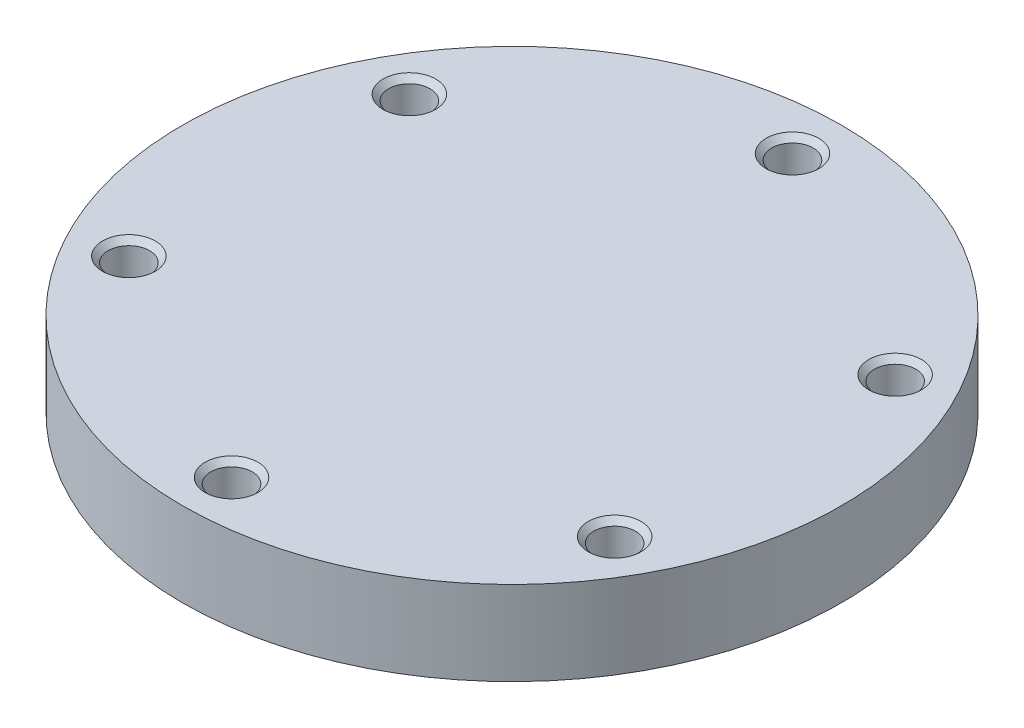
ISO-10303-21;
HEADER;
FILE_DESCRIPTION(('STEP AP214'),'2;1');
FILE_NAME('part.step','',(''),(''),'','','');
FILE_SCHEMA(('AUTOMOTIVE_DESIGN { 1 0 10303 214 1 1 1 1 }'));
ENDSEC;
DATA;
#1=APPLICATION_CONTEXT('core data for automotive mechanical design processes');
#2=APPLICATION_PROTOCOL_DEFINITION('international standard','automotive_design',2000,#1);
#3=PRODUCT_CONTEXT('',#1,'mechanical');
#4=PRODUCT('Part','Part','',(#3));
#5=PRODUCT_RELATED_PRODUCT_CATEGORY('part','',(#4));
#6=PRODUCT_DEFINITION_FORMATION('','',#4);
#7=PRODUCT_DEFINITION_CONTEXT('part definition',#1,'design');
#8=PRODUCT_DEFINITION('design','',#6,#7);
#9=PRODUCT_DEFINITION_SHAPE('','',#8);
#10=(LENGTH_UNIT() NAMED_UNIT(*) SI_UNIT(.MILLI.,.METRE.));
#11=(NAMED_UNIT(*) PLANE_ANGLE_UNIT() SI_UNIT($,.RADIAN.));
#12=(NAMED_UNIT(*) SI_UNIT($,.STERADIAN.) SOLID_ANGLE_UNIT());
#13=UNCERTAINTY_MEASURE_WITH_UNIT(LENGTH_MEASURE(1.E-05),#10,'distance_accuracy_value','');
#14=(GEOMETRIC_REPRESENTATION_CONTEXT(3) GLOBAL_UNCERTAINTY_ASSIGNED_CONTEXT((#13)) GLOBAL_UNIT_ASSIGNED_CONTEXT((#10,
#11,#12)) REPRESENTATION_CONTEXT('',''));
#15=CARTESIAN_POINT('',(0.,0.,0.));
#16=DIRECTION('',(0.,0.,1.));
#17=DIRECTION('',(1.,0.,0.));
#18=AXIS2_PLACEMENT_3D('',#15,#16,#17);
#19=CARTESIAN_POINT('',(0.,9.525,0.));
#20=DIRECTION('',(0.,-1.,0.));
#21=DIRECTION('',(0.,0.,-1.));
#22=AXIS2_PLACEMENT_3D('',#19,#20,#21);
#23=CYLINDRICAL_SURFACE('',#22,37.30625);
#24=CARTESIAN_POINT('',(0.,9.525,0.));
#25=DIRECTION('',(0.,1.,0.));
#26=DIRECTION('',(0.,0.,1.));
#27=AXIS2_PLACEMENT_3D('',#24,#25,#26);
#28=CIRCLE('',#27,37.30625);
#29=CARTESIAN_POINT('',(0.,9.525,-37.30625));
#30=VERTEX_POINT('',#29);
#31=EDGE_CURVE('E10',#30,#30,#28,.T.);
#32=CARTESIAN_POINT('',(0.,0.,0.));
#33=DIRECTION('',(0.,1.,0.));
#34=DIRECTION('',(0.,0.,1.));
#35=AXIS2_PLACEMENT_3D('',#32,#33,#34);
#36=CIRCLE('',#35,37.30625);
#37=CARTESIAN_POINT('',(0.,0.,-37.30625));
#38=VERTEX_POINT('',#37);
#39=EDGE_CURVE('E37',#38,#38,#36,.T.);
#40=CARTESIAN_POINT('',(0.,9.525,-37.30625));
#41=CARTESIAN_POINT('',(0.,9.42578125,-37.30625));
#42=CARTESIAN_POINT('',(0.,9.3265625,-37.30625));
#43=CARTESIAN_POINT('',(0.,9.128125,-37.30625));
#44=CARTESIAN_POINT('',(0.,9.02890625,-37.30625));
#45=CARTESIAN_POINT('',(0.,8.83046875,-37.30625));
#46=CARTESIAN_POINT('',(0.,8.73125,-37.30625));
#47=CARTESIAN_POINT('',(0.,8.5328125,-37.30625));
#48=CARTESIAN_POINT('',(0.,8.43359375,-37.30625));
#49=CARTESIAN_POINT('',(0.,8.23515625,-37.30625));
#50=CARTESIAN_POINT('',(0.,8.1359375,-37.30625));
#51=CARTESIAN_POINT('',(0.,7.9375,-37.30625));
#52=CARTESIAN_POINT('',(0.,7.83828125,-37.30625));
#53=CARTESIAN_POINT('',(0.,7.63984375,-37.30625));
#54=CARTESIAN_POINT('',(0.,7.540625,-37.30625));
#55=CARTESIAN_POINT('',(0.,7.3421875,-37.30625));
#56=CARTESIAN_POINT('',(0.,7.24296875,-37.30625));
#57=CARTESIAN_POINT('',(0.,7.04453125,-37.30625));
#58=CARTESIAN_POINT('',(0.,6.9453125,-37.30625));
#59=CARTESIAN_POINT('',(0.,6.746875,-37.30625));
#60=CARTESIAN_POINT('',(0.,6.64765625,-37.30625));
#61=CARTESIAN_POINT('',(0.,6.44921875,-37.30625));
#62=CARTESIAN_POINT('',(0.,6.35,-37.30625));
#63=CARTESIAN_POINT('',(0.,6.1515625,-37.30625));
#64=CARTESIAN_POINT('',(0.,6.05234375,-37.30625));
#65=CARTESIAN_POINT('',(0.,5.85390625,-37.30625));
#66=CARTESIAN_POINT('',(0.,5.7546875,-37.30625));
#67=CARTESIAN_POINT('',(0.,5.55625,-37.30625));
#68=CARTESIAN_POINT('',(0.,5.45703125,-37.30625));
#69=CARTESIAN_POINT('',(0.,5.25859375,-37.30625));
#70=CARTESIAN_POINT('',(0.,5.159375,-37.30625));
#71=CARTESIAN_POINT('',(0.,4.9609375,-37.30625));
#72=CARTESIAN_POINT('',(0.,4.86171875,-37.30625));
#73=CARTESIAN_POINT('',(0.,4.66328125,-37.30625));
#74=CARTESIAN_POINT('',(0.,4.5640625,-37.30625));
#75=CARTESIAN_POINT('',(0.,4.365625,-37.30625));
#76=CARTESIAN_POINT('',(0.,4.26640625,-37.30625));
#77=CARTESIAN_POINT('',(0.,4.06796875,-37.30625));
#78=CARTESIAN_POINT('',(0.,3.96875,-37.30625));
#79=CARTESIAN_POINT('',(0.,3.7703125,-37.30625));
#80=CARTESIAN_POINT('',(0.,3.67109375,-37.30625));
#81=CARTESIAN_POINT('',(0.,3.47265625,-37.30625));
#82=CARTESIAN_POINT('',(0.,3.3734375,-37.30625));
#83=CARTESIAN_POINT('',(0.,3.175,-37.30625));
#84=CARTESIAN_POINT('',(0.,3.07578125,-37.30625));
#85=CARTESIAN_POINT('',(0.,2.87734375,-37.30625));
#86=CARTESIAN_POINT('',(0.,2.778125,-37.30625));
#87=CARTESIAN_POINT('',(0.,2.5796875,-37.30625));
#88=CARTESIAN_POINT('',(0.,2.48046875,-37.30625));
#89=CARTESIAN_POINT('',(0.,2.28203125,-37.30625));
#90=CARTESIAN_POINT('',(0.,2.1828125,-37.30625));
#91=CARTESIAN_POINT('',(0.,1.984375,-37.30625));
#92=CARTESIAN_POINT('',(0.,1.88515625,-37.30625));
#93=CARTESIAN_POINT('',(0.,1.68671875,-37.30625));
#94=CARTESIAN_POINT('',(0.,1.5875,-37.30625));
#95=CARTESIAN_POINT('',(0.,1.3890625,-37.30625));
#96=CARTESIAN_POINT('',(0.,1.28984375,-37.30625));
#97=CARTESIAN_POINT('',(0.,1.09140625,-37.30625));
#98=CARTESIAN_POINT('',(0.,0.992187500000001,-37.30625));
#99=CARTESIAN_POINT('',(0.,0.793750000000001,-37.30625));
#100=CARTESIAN_POINT('',(0.,0.69453125,-37.30625));
#101=CARTESIAN_POINT('',(0.,0.49609375,-37.30625));
#102=CARTESIAN_POINT('',(0.,0.396875,-37.30625));
#103=CARTESIAN_POINT('',(0.,0.1984375,-37.30625));
#104=CARTESIAN_POINT('',(0.,0.0992187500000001,-37.30625));
#105=CARTESIAN_POINT('',(0.,0.,-37.30625));
#106=B_SPLINE_CURVE_WITH_KNOTS('',3,(#40,#41,#42,#43,#44,#45,#46,#47,#48,#49,#50,#51,#52,#53,
#54,#55,#56,#57,#58,#59,#60,#61,#62,#63,#64,#65,#66,#67,#68,#69,#70,#71,#72,#73,#74,#75,#76,#77,
#78,#79,#80,#81,#82,#83,#84,#85,#86,#87,#88,#89,#90,#91,#92,#93,#94,#95,#96,#97,#98,#99,#100,
#101,#102,#103,#104,#105),.UNSPECIFIED.,.F.,.F.,(4,2,2,2,2,2,2,2,2,2,2,2,2,2,2,2,2,2,2,2,2,2,2,
2,2,2,2,2,2,2,2,2,4),(0.,0.297656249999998,0.595312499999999,0.892968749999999,1.190625,
1.48828125,1.7859375,2.08359375,2.38125,2.67890625,2.9765625,3.27421875,3.571875,3.86953125,
4.1671875,4.46484375,4.7625,5.06015625,5.3578125,5.65546875,5.953125,6.25078125,6.5484375,
6.84609375,7.14375,7.44140625,7.7390625,8.03671875,8.334375,8.63203125,8.9296875,9.22734375,
9.525),.UNSPECIFIED.);
#107=EDGE_CURVE('BSEAM34',#30,#38,#106,.T.);
#108=ORIENTED_EDGE('',*,*,#31,.F.);
#109=ORIENTED_EDGE('',*,*,#39,.T.);
#110=ORIENTED_EDGE('',*,*,#107,.T.);
#111=ORIENTED_EDGE('',*,*,#107,.F.);
#112=EDGE_LOOP('',(#108,#110,#109,#111));
#113=FACE_BOUND('',#112,.T.);
#114=ADVANCED_FACE('F34',(#113),#23,.T.);
#115=CARTESIAN_POINT('',(0.,9.525,0.));
#116=DIRECTION('',(0.,1.,0.));
#117=DIRECTION('',(0.,0.,1.));
#118=AXIS2_PLACEMENT_3D('',#115,#116,#117);
#119=PLANE('',#118);
#120=CARTESIAN_POINT('',(0.,9.525,-31.75));
#121=DIRECTION('',(0.,1.,0.));
#122=DIRECTION('',(0.,0.,1.));
#123=AXIS2_PLACEMENT_3D('',#120,#121,#122);
#124=CIRCLE('',#123,2.9845);
#125=CARTESIAN_POINT('',(0.,9.525,-28.7655));
#126=VERTEX_POINT('',#125);
#127=EDGE_CURVE('E111',#126,#126,#124,.T.);
#128=ORIENTED_EDGE('',*,*,#127,.F.);
#129=EDGE_LOOP('',(#128));
#130=FACE_BOUND('',#129,.T.);
#131=CARTESIAN_POINT('',(27.4963065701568,9.525,-15.8750000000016));
#132=DIRECTION('',(0.,1.,0.));
#133=DIRECTION('',(0.,0.,1.));
#134=AXIS2_PLACEMENT_3D('',#131,#132,#133);
#135=CIRCLE('',#134,2.9845);
#136=CARTESIAN_POINT('',(27.4963065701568,9.525,-12.8905000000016));
#137=VERTEX_POINT('',#136);
#138=EDGE_CURVE('E99',#137,#137,#135,.T.);
#139=ORIENTED_EDGE('',*,*,#138,.F.);
#140=EDGE_LOOP('',(#139));
#141=FACE_BOUND('',#140,.T.);
#142=CARTESIAN_POINT('',(27.4963065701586,9.525,15.8749999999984));
#143=DIRECTION('',(0.,1.,0.));
#144=DIRECTION('',(0.,0.,1.));
#145=AXIS2_PLACEMENT_3D('',#142,#143,#144);
#146=CIRCLE('',#145,2.9845);
#147=CARTESIAN_POINT('',(27.4963065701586,9.525,18.8594999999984));
#148=VERTEX_POINT('',#147);
#149=EDGE_CURVE('E87',#148,#148,#146,.T.);
#150=ORIENTED_EDGE('',*,*,#149,.F.);
#151=EDGE_LOOP('',(#150));
#152=FACE_BOUND('',#151,.T.);
#153=CARTESIAN_POINT('',(3.59789233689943E-12,9.525,31.75));
#154=DIRECTION('',(0.,1.,0.));
#155=DIRECTION('',(0.,0.,1.));
#156=AXIS2_PLACEMENT_3D('',#153,#154,#155);
#157=CIRCLE('',#156,2.9845);
#158=CARTESIAN_POINT('',(3.59789233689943E-12,9.525,34.7345));
#159=VERTEX_POINT('',#158);
#160=EDGE_CURVE('E75',#159,#159,#157,.T.);
#161=ORIENTED_EDGE('',*,*,#160,.F.);
#162=EDGE_LOOP('',(#161));
#163=FACE_BOUND('',#162,.T.);
#164=CARTESIAN_POINT('',(-27.4963065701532,9.525,15.8750000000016));
#165=DIRECTION('',(0.,1.,0.));
#166=DIRECTION('',(0.,0.,1.));
#167=AXIS2_PLACEMENT_3D('',#164,#165,#166);
#168=CIRCLE('',#167,2.9845);
#169=CARTESIAN_POINT('',(-27.4963065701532,9.525,18.8595000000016));
#170=VERTEX_POINT('',#169);
#171=EDGE_CURVE('E63',#170,#170,#168,.T.);
#172=ORIENTED_EDGE('',*,*,#171,.F.);
#173=EDGE_LOOP('',(#172));
#174=FACE_BOUND('',#173,.T.);
#175=CARTESIAN_POINT('',(-27.496306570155,9.525,-15.8749999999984));
#176=DIRECTION('',(0.,1.,0.));
#177=DIRECTION('',(0.,0.,1.));
#178=AXIS2_PLACEMENT_3D('',#175,#176,#177);
#179=CIRCLE('',#178,2.9845);
#180=CARTESIAN_POINT('',(-27.496306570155,9.525,-12.8904999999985));
#181=VERTEX_POINT('',#180);
#182=EDGE_CURVE('E51',#181,#181,#179,.T.);
#183=ORIENTED_EDGE('',*,*,#182,.F.);
#184=EDGE_LOOP('',(#183));
#185=FACE_BOUND('',#184,.T.);
#186=ORIENTED_EDGE('',*,*,#31,.T.);
#187=EDGE_LOOP('',(#186));
#188=FACE_BOUND('',#187,.T.);
#189=ADVANCED_FACE('F150',(#130,#141,#152,#163,#174,#185,#188),#119,.T.);
#190=CARTESIAN_POINT('',(0.,0.,0.));
#191=DIRECTION('',(0.,1.,0.));
#192=DIRECTION('',(0.,0.,1.));
#193=AXIS2_PLACEMENT_3D('',#190,#191,#192);
#194=PLANE('',#193);
#195=CARTESIAN_POINT('',(0.,0.,0.));
#196=DIRECTION('',(0.,-1.,0.));
#197=DIRECTION('',(0.,0.,-1.));
#198=AXIS2_PLACEMENT_3D('',#195,#196,#197);
#199=CIRCLE('',#198,27.6987);
#200=CARTESIAN_POINT('',(0.,0.,-27.6987));
#201=VERTEX_POINT('',#200);
#202=EDGE_CURVE('E118',#201,#201,#199,.T.);
#203=ORIENTED_EDGE('',*,*,#202,.F.);
#204=EDGE_LOOP('',(#203));
#205=FACE_BOUND('',#204,.T.);
#206=CARTESIAN_POINT('',(0.,0.,-31.75));
#207=DIRECTION('',(0.,1.,0.));
#208=DIRECTION('',(0.,0.,1.));
#209=AXIS2_PLACEMENT_3D('',#206,#207,#208);
#210=CIRCLE('',#209,2.9845);
#211=CARTESIAN_POINT('',(0.,0.,-28.7655));
#212=VERTEX_POINT('',#211);
#213=EDGE_CURVE('E114',#212,#212,#210,.T.);
#214=ORIENTED_EDGE('',*,*,#213,.T.);
#215=EDGE_LOOP('',(#214));
#216=FACE_BOUND('',#215,.T.);
#217=CARTESIAN_POINT('',(27.4963065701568,0.,-15.8750000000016));
#218=DIRECTION('',(0.,1.,0.));
#219=DIRECTION('',(0.,0.,1.));
#220=AXIS2_PLACEMENT_3D('',#217,#218,#219);
#221=CIRCLE('',#220,2.9845);
#222=CARTESIAN_POINT('',(27.4963065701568,0.,-12.8905000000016));
#223=VERTEX_POINT('',#222);
#224=EDGE_CURVE('E102',#223,#223,#221,.T.);
#225=ORIENTED_EDGE('',*,*,#224,.T.);
#226=EDGE_LOOP('',(#225));
#227=FACE_BOUND('',#226,.T.);
#228=CARTESIAN_POINT('',(27.4963065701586,0.,15.8749999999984));
#229=DIRECTION('',(0.,1.,0.));
#230=DIRECTION('',(0.,0.,1.));
#231=AXIS2_PLACEMENT_3D('',#228,#229,#230);
#232=CIRCLE('',#231,2.9845);
#233=CARTESIAN_POINT('',(27.4963065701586,0.,18.8594999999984));
#234=VERTEX_POINT('',#233);
#235=EDGE_CURVE('E90',#234,#234,#232,.T.);
#236=ORIENTED_EDGE('',*,*,#235,.T.);
#237=EDGE_LOOP('',(#236));
#238=FACE_BOUND('',#237,.T.);
#239=CARTESIAN_POINT('',(3.59789233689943E-12,0.,31.75));
#240=DIRECTION('',(0.,1.,0.));
#241=DIRECTION('',(0.,0.,1.));
#242=AXIS2_PLACEMENT_3D('',#239,#240,#241);
#243=CIRCLE('',#242,2.9845);
#244=CARTESIAN_POINT('',(3.59789233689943E-12,0.,34.7345));
#245=VERTEX_POINT('',#244);
#246=EDGE_CURVE('E78',#245,#245,#243,.T.);
#247=ORIENTED_EDGE('',*,*,#246,.T.);
#248=EDGE_LOOP('',(#247));
#249=FACE_BOUND('',#248,.T.);
#250=CARTESIAN_POINT('',(-27.4963065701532,0.,15.8750000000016));
#251=DIRECTION('',(0.,1.,0.));
#252=DIRECTION('',(0.,0.,1.));
#253=AXIS2_PLACEMENT_3D('',#250,#251,#252);
#254=CIRCLE('',#253,2.9845);
#255=CARTESIAN_POINT('',(-27.4963065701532,0.,18.8595000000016));
#256=VERTEX_POINT('',#255);
#257=EDGE_CURVE('E66',#256,#256,#254,.T.);
#258=ORIENTED_EDGE('',*,*,#257,.T.);
#259=EDGE_LOOP('',(#258));
#260=FACE_BOUND('',#259,.T.);
#261=CARTESIAN_POINT('',(-27.496306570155,0.,-15.8749999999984));
#262=DIRECTION('',(0.,1.,0.));
#263=DIRECTION('',(0.,0.,1.));
#264=AXIS2_PLACEMENT_3D('',#261,#262,#263);
#265=CIRCLE('',#264,2.9845);
#266=CARTESIAN_POINT('',(-27.496306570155,0.,-12.8904999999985));
#267=VERTEX_POINT('',#266);
#268=EDGE_CURVE('E54',#267,#267,#265,.T.);
#269=ORIENTED_EDGE('',*,*,#268,.T.);
#270=EDGE_LOOP('',(#269));
#271=FACE_BOUND('',#270,.T.);
#272=ORIENTED_EDGE('',*,*,#39,.F.);
#273=EDGE_LOOP('',(#272));
#274=FACE_BOUND('',#273,.T.);
#275=ADVANCED_FACE('F146',(#205,#216,#227,#238,#249,#260,#271,#274),#194,.F.);
#276=CARTESIAN_POINT('',(-27.496306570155,0.635000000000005,-15.8749999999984));
#277=DIRECTION('',(0.,-1.,0.));
#278=DIRECTION('',(0.,0.,-1.));
#279=AXIS2_PLACEMENT_3D('',#276,#277,#278);
#280=CONICAL_SURFACE('',#279,2.3495,0.785398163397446);
#281=ORIENTED_EDGE('',*,*,#268,.F.);
#282=EDGE_LOOP('',(#281));
#283=FACE_BOUND('',#282,.T.);
#284=CARTESIAN_POINT('',(-27.496306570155,0.635000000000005,-15.8749999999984));
#285=DIRECTION('',(0.,1.,0.));
#286=DIRECTION('',(0.,0.,1.));
#287=AXIS2_PLACEMENT_3D('',#284,#285,#286);
#288=CIRCLE('',#287,2.3495);
#289=CARTESIAN_POINT('',(-27.496306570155,0.635000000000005,-13.5254999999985));
#290=VERTEX_POINT('',#289);
#291=EDGE_CURVE('E44',#290,#290,#288,.T.);
#292=ORIENTED_EDGE('',*,*,#291,.T.);
#293=EDGE_LOOP('',(#292));
#294=FACE_BOUND('',#293,.T.);
#295=ADVANCED_FACE('F149',(#283,#294),#280,.F.);
#296=CARTESIAN_POINT('',(-27.496306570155,9.525,-15.8749999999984));
#297=DIRECTION('',(0.,1.,0.));
#298=DIRECTION('',(0.,0.,1.));
#299=AXIS2_PLACEMENT_3D('',#296,#297,#298);
#300=CYLINDRICAL_SURFACE('',#299,2.3495);
#301=ORIENTED_EDGE('',*,*,#291,.F.);
#302=EDGE_LOOP('',(#301));
#303=FACE_BOUND('',#302,.T.);
#304=CARTESIAN_POINT('',(-27.496306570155,8.89,-15.8749999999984));
#305=DIRECTION('',(0.,1.,0.));
#306=DIRECTION('',(0.,0.,1.));
#307=AXIS2_PLACEMENT_3D('',#304,#305,#306);
#308=CIRCLE('',#307,2.3495);
#309=CARTESIAN_POINT('',(-27.496306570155,8.89,-13.5254999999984));
#310=VERTEX_POINT('',#309);
#311=EDGE_CURVE('E48',#310,#310,#308,.T.);
#312=ORIENTED_EDGE('',*,*,#311,.T.);
#313=EDGE_LOOP('',(#312));
#314=FACE_BOUND('',#313,.T.);
#315=ADVANCED_FACE('F180',(#303,#314),#300,.F.);
#316=CARTESIAN_POINT('',(-27.496306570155,9.525,-15.8749999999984));
#317=DIRECTION('',(0.,1.,0.));
#318=DIRECTION('',(0.,0.,1.));
#319=AXIS2_PLACEMENT_3D('',#316,#317,#318);
#320=CONICAL_SURFACE('',#319,2.9845,0.785398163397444);
#321=ORIENTED_EDGE('',*,*,#311,.F.);
#322=EDGE_LOOP('',(#321));
#323=FACE_BOUND('',#322,.T.);
#324=ORIENTED_EDGE('',*,*,#182,.T.);
#325=EDGE_LOOP('',(#324));
#326=FACE_BOUND('',#325,.T.);
#327=ADVANCED_FACE('F184',(#323,#326),#320,.F.);
#328=CARTESIAN_POINT('',(-27.4963065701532,0.635000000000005,15.8750000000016));
#329=DIRECTION('',(0.,-1.,0.));
#330=DIRECTION('',(0.,0.,-1.));
#331=AXIS2_PLACEMENT_3D('',#328,#329,#330);
#332=CONICAL_SURFACE('',#331,2.3495,0.785398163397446);
#333=ORIENTED_EDGE('',*,*,#257,.F.);
#334=EDGE_LOOP('',(#333));
#335=FACE_BOUND('',#334,.T.);
#336=CARTESIAN_POINT('',(-27.4963065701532,0.635000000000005,15.8750000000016));
#337=DIRECTION('',(0.,1.,0.));
#338=DIRECTION('',(0.,0.,1.));
#339=AXIS2_PLACEMENT_3D('',#336,#337,#338);
#340=CIRCLE('',#339,2.3495);
#341=CARTESIAN_POINT('',(-27.4963065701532,0.635000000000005,18.2245000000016));
#342=VERTEX_POINT('',#341);
#343=EDGE_CURVE('E57',#342,#342,#340,.T.);
#344=ORIENTED_EDGE('',*,*,#343,.T.);
#345=EDGE_LOOP('',(#344));
#346=FACE_BOUND('',#345,.T.);
#347=ADVANCED_FACE('F188',(#335,#346),#332,.F.);
#348=CARTESIAN_POINT('',(-27.4963065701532,9.525,15.8750000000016));
#349=DIRECTION('',(0.,1.,0.));
#350=DIRECTION('',(0.,0.,1.));
#351=AXIS2_PLACEMENT_3D('',#348,#349,#350);
#352=CYLINDRICAL_SURFACE('',#351,2.3495);
#353=ORIENTED_EDGE('',*,*,#343,.F.);
#354=EDGE_LOOP('',(#353));
#355=FACE_BOUND('',#354,.T.);
#356=CARTESIAN_POINT('',(-27.4963065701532,8.89,15.8750000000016));
#357=DIRECTION('',(0.,1.,0.));
#358=DIRECTION('',(0.,0.,1.));
#359=AXIS2_PLACEMENT_3D('',#356,#357,#358);
#360=CIRCLE('',#359,2.3495);
#361=CARTESIAN_POINT('',(-27.4963065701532,8.89,18.2245000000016));
#362=VERTEX_POINT('',#361);
#363=EDGE_CURVE('E60',#362,#362,#360,.T.);
#364=ORIENTED_EDGE('',*,*,#363,.T.);
#365=EDGE_LOOP('',(#364));
#366=FACE_BOUND('',#365,.T.);
#367=ADVANCED_FACE('F192',(#355,#366),#352,.F.);
#368=CARTESIAN_POINT('',(-27.4963065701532,9.525,15.8750000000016));
#369=DIRECTION('',(0.,1.,0.));
#370=DIRECTION('',(0.,0.,1.));
#371=AXIS2_PLACEMENT_3D('',#368,#369,#370);
#372=CONICAL_SURFACE('',#371,2.9845,0.785398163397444);
#373=ORIENTED_EDGE('',*,*,#363,.F.);
#374=EDGE_LOOP('',(#373));
#375=FACE_BOUND('',#374,.T.);
#376=ORIENTED_EDGE('',*,*,#171,.T.);
#377=EDGE_LOOP('',(#376));
#378=FACE_BOUND('',#377,.T.);
#379=ADVANCED_FACE('F196',(#375,#378),#372,.F.);
#380=CARTESIAN_POINT('',(3.59789233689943E-12,0.635000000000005,31.75));
#381=DIRECTION('',(0.,-1.,0.));
#382=DIRECTION('',(0.,0.,-1.));
#383=AXIS2_PLACEMENT_3D('',#380,#381,#382);
#384=CONICAL_SURFACE('',#383,2.3495,0.785398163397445);
#385=ORIENTED_EDGE('',*,*,#246,.F.);
#386=EDGE_LOOP('',(#385));
#387=FACE_BOUND('',#386,.T.);
#388=CARTESIAN_POINT('',(3.59789233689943E-12,0.635000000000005,31.75));
#389=DIRECTION('',(0.,1.,0.));
#390=DIRECTION('',(0.,0.,1.));
#391=AXIS2_PLACEMENT_3D('',#388,#389,#390);
#392=CIRCLE('',#391,2.3495);
#393=CARTESIAN_POINT('',(3.59789233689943E-12,0.635000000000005,34.0995));
#394=VERTEX_POINT('',#393);
#395=EDGE_CURVE('E69',#394,#394,#392,.T.);
#396=ORIENTED_EDGE('',*,*,#395,.T.);
#397=EDGE_LOOP('',(#396));
#398=FACE_BOUND('',#397,.T.);
#399=ADVANCED_FACE('F200',(#387,#398),#384,.F.);
#400=CARTESIAN_POINT('',(3.59789233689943E-12,9.525,31.75));
#401=DIRECTION('',(0.,1.,0.));
#402=DIRECTION('',(0.,0.,1.));
#403=AXIS2_PLACEMENT_3D('',#400,#401,#402);
#404=CYLINDRICAL_SURFACE('',#403,2.3495);
#405=ORIENTED_EDGE('',*,*,#395,.F.);
#406=EDGE_LOOP('',(#405));
#407=FACE_BOUND('',#406,.T.);
#408=CARTESIAN_POINT('',(3.59789233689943E-12,8.89,31.75));
#409=DIRECTION('',(0.,1.,0.));
#410=DIRECTION('',(0.,0.,1.));
#411=AXIS2_PLACEMENT_3D('',#408,#409,#410);
#412=CIRCLE('',#411,2.3495);
#413=CARTESIAN_POINT('',(3.59789233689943E-12,8.89,34.0995));
#414=VERTEX_POINT('',#413);
#415=EDGE_CURVE('E72',#414,#414,#412,.T.);
#416=ORIENTED_EDGE('',*,*,#415,.T.);
#417=EDGE_LOOP('',(#416));
#418=FACE_BOUND('',#417,.T.);
#419=ADVANCED_FACE('F204',(#407,#418),#404,.F.);
#420=CARTESIAN_POINT('',(3.59789233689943E-12,9.525,31.75));
#421=DIRECTION('',(0.,1.,0.));
#422=DIRECTION('',(0.,0.,1.));
#423=AXIS2_PLACEMENT_3D('',#420,#421,#422);
#424=CONICAL_SURFACE('',#423,2.9845,0.785398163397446);
#425=ORIENTED_EDGE('',*,*,#415,.F.);
#426=EDGE_LOOP('',(#425));
#427=FACE_BOUND('',#426,.T.);
#428=ORIENTED_EDGE('',*,*,#160,.T.);
#429=EDGE_LOOP('',(#428));
#430=FACE_BOUND('',#429,.T.);
#431=ADVANCED_FACE('F208',(#427,#430),#424,.F.);
#432=CARTESIAN_POINT('',(27.4963065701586,0.635000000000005,15.8749999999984));
#433=DIRECTION('',(0.,-1.,0.));
#434=DIRECTION('',(0.,0.,-1.));
#435=AXIS2_PLACEMENT_3D('',#432,#433,#434);
#436=CONICAL_SURFACE('',#435,2.3495,0.785398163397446);
#437=ORIENTED_EDGE('',*,*,#235,.F.);
#438=EDGE_LOOP('',(#437));
#439=FACE_BOUND('',#438,.T.);
#440=CARTESIAN_POINT('',(27.4963065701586,0.635000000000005,15.8749999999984));
#441=DIRECTION('',(0.,1.,0.));
#442=DIRECTION('',(0.,0.,1.));
#443=AXIS2_PLACEMENT_3D('',#440,#441,#442);
#444=CIRCLE('',#443,2.3495);
#445=CARTESIAN_POINT('',(27.4963065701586,0.635000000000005,18.2244999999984));
#446=VERTEX_POINT('',#445);
#447=EDGE_CURVE('E81',#446,#446,#444,.T.);
#448=ORIENTED_EDGE('',*,*,#447,.T.);
#449=EDGE_LOOP('',(#448));
#450=FACE_BOUND('',#449,.T.);
#451=ADVANCED_FACE('F212',(#439,#450),#436,.F.);
#452=CARTESIAN_POINT('',(27.4963065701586,9.525,15.8749999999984));
#453=DIRECTION('',(0.,1.,0.));
#454=DIRECTION('',(0.,0.,1.));
#455=AXIS2_PLACEMENT_3D('',#452,#453,#454);
#456=CYLINDRICAL_SURFACE('',#455,2.3495);
#457=ORIENTED_EDGE('',*,*,#447,.F.);
#458=EDGE_LOOP('',(#457));
#459=FACE_BOUND('',#458,.T.);
#460=CARTESIAN_POINT('',(27.4963065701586,8.89,15.8749999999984));
#461=DIRECTION('',(0.,1.,0.));
#462=DIRECTION('',(0.,0.,1.));
#463=AXIS2_PLACEMENT_3D('',#460,#461,#462);
#464=CIRCLE('',#463,2.3495);
#465=CARTESIAN_POINT('',(27.4963065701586,8.89,18.2244999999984));
#466=VERTEX_POINT('',#465);
#467=EDGE_CURVE('E84',#466,#466,#464,.T.);
#468=ORIENTED_EDGE('',*,*,#467,.T.);
#469=EDGE_LOOP('',(#468));
#470=FACE_BOUND('',#469,.T.);
#471=ADVANCED_FACE('F216',(#459,#470),#456,.F.);
#472=CARTESIAN_POINT('',(27.4963065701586,9.525,15.8749999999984));
#473=DIRECTION('',(0.,1.,0.));
#474=DIRECTION('',(0.,0.,1.));
#475=AXIS2_PLACEMENT_3D('',#472,#473,#474);
#476=CONICAL_SURFACE('',#475,2.9845,0.785398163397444);
#477=ORIENTED_EDGE('',*,*,#467,.F.);
#478=EDGE_LOOP('',(#477));
#479=FACE_BOUND('',#478,.T.);
#480=ORIENTED_EDGE('',*,*,#149,.T.);
#481=EDGE_LOOP('',(#480));
#482=FACE_BOUND('',#481,.T.);
#483=ADVANCED_FACE('F220',(#479,#482),#476,.F.);
#484=CARTESIAN_POINT('',(27.4963065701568,0.635000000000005,-15.8750000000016));
#485=DIRECTION('',(0.,-1.,0.));
#486=DIRECTION('',(0.,0.,-1.));
#487=AXIS2_PLACEMENT_3D('',#484,#485,#486);
#488=CONICAL_SURFACE('',#487,2.3495,0.785398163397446);
#489=ORIENTED_EDGE('',*,*,#224,.F.);
#490=EDGE_LOOP('',(#489));
#491=FACE_BOUND('',#490,.T.);
#492=CARTESIAN_POINT('',(27.4963065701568,0.635000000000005,-15.8750000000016));
#493=DIRECTION('',(0.,1.,0.));
#494=DIRECTION('',(0.,0.,1.));
#495=AXIS2_PLACEMENT_3D('',#492,#493,#494);
#496=CIRCLE('',#495,2.3495);
#497=CARTESIAN_POINT('',(27.4963065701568,0.635000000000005,-13.5255000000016));
#498=VERTEX_POINT('',#497);
#499=EDGE_CURVE('E93',#498,#498,#496,.T.);
#500=ORIENTED_EDGE('',*,*,#499,.T.);
#501=EDGE_LOOP('',(#500));
#502=FACE_BOUND('',#501,.T.);
#503=ADVANCED_FACE('F224',(#491,#502),#488,.F.);
#504=CARTESIAN_POINT('',(27.4963065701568,9.525,-15.8750000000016));
#505=DIRECTION('',(0.,1.,0.));
#506=DIRECTION('',(0.,0.,1.));
#507=AXIS2_PLACEMENT_3D('',#504,#505,#506);
#508=CYLINDRICAL_SURFACE('',#507,2.3495);
#509=ORIENTED_EDGE('',*,*,#499,.F.);
#510=EDGE_LOOP('',(#509));
#511=FACE_BOUND('',#510,.T.);
#512=CARTESIAN_POINT('',(27.4963065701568,8.89,-15.8750000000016));
#513=DIRECTION('',(0.,1.,0.));
#514=DIRECTION('',(0.,0.,1.));
#515=AXIS2_PLACEMENT_3D('',#512,#513,#514);
#516=CIRCLE('',#515,2.3495);
#517=CARTESIAN_POINT('',(27.4963065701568,8.89,-13.5255000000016));
#518=VERTEX_POINT('',#517);
#519=EDGE_CURVE('E96',#518,#518,#516,.T.);
#520=ORIENTED_EDGE('',*,*,#519,.T.);
#521=EDGE_LOOP('',(#520));
#522=FACE_BOUND('',#521,.T.);
#523=ADVANCED_FACE('F228',(#511,#522),#508,.F.);
#524=CARTESIAN_POINT('',(27.4963065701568,9.525,-15.8750000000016));
#525=DIRECTION('',(0.,1.,0.));
#526=DIRECTION('',(0.,0.,1.));
#527=AXIS2_PLACEMENT_3D('',#524,#525,#526);
#528=CONICAL_SURFACE('',#527,2.9845,0.785398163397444);
#529=ORIENTED_EDGE('',*,*,#519,.F.);
#530=EDGE_LOOP('',(#529));
#531=FACE_BOUND('',#530,.T.);
#532=ORIENTED_EDGE('',*,*,#138,.T.);
#533=EDGE_LOOP('',(#532));
#534=FACE_BOUND('',#533,.T.);
#535=ADVANCED_FACE('F232',(#531,#534),#528,.F.);
#536=CARTESIAN_POINT('',(0.,0.635000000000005,-31.75));
#537=DIRECTION('',(0.,-1.,0.));
#538=DIRECTION('',(0.,0.,-1.));
#539=AXIS2_PLACEMENT_3D('',#536,#537,#538);
#540=CONICAL_SURFACE('',#539,2.3495,0.785398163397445);
#541=ORIENTED_EDGE('',*,*,#213,.F.);
#542=EDGE_LOOP('',(#541));
#543=FACE_BOUND('',#542,.T.);
#544=CARTESIAN_POINT('',(0.,0.635000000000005,-31.75));
#545=DIRECTION('',(0.,1.,0.));
#546=DIRECTION('',(0.,0.,1.));
#547=AXIS2_PLACEMENT_3D('',#544,#545,#546);
#548=CIRCLE('',#547,2.3495);
#549=CARTESIAN_POINT('',(0.,0.635000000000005,-29.4005));
#550=VERTEX_POINT('',#549);
#551=EDGE_CURVE('E105',#550,#550,#548,.T.);
#552=ORIENTED_EDGE('',*,*,#551,.T.);
#553=EDGE_LOOP('',(#552));
#554=FACE_BOUND('',#553,.T.);
#555=ADVANCED_FACE('F236',(#543,#554),#540,.F.);
#556=CARTESIAN_POINT('',(0.,9.525,-31.75));
#557=DIRECTION('',(0.,1.,0.));
#558=DIRECTION('',(0.,0.,1.));
#559=AXIS2_PLACEMENT_3D('',#556,#557,#558);
#560=CYLINDRICAL_SURFACE('',#559,2.3495);
#561=ORIENTED_EDGE('',*,*,#551,.F.);
#562=EDGE_LOOP('',(#561));
#563=FACE_BOUND('',#562,.T.);
#564=CARTESIAN_POINT('',(0.,8.89,-31.75));
#565=DIRECTION('',(0.,1.,0.));
#566=DIRECTION('',(0.,0.,1.));
#567=AXIS2_PLACEMENT_3D('',#564,#565,#566);
#568=CIRCLE('',#567,2.3495);
#569=CARTESIAN_POINT('',(0.,8.89,-29.4005));
#570=VERTEX_POINT('',#569);
#571=EDGE_CURVE('E108',#570,#570,#568,.T.);
#572=ORIENTED_EDGE('',*,*,#571,.T.);
#573=EDGE_LOOP('',(#572));
#574=FACE_BOUND('',#573,.T.);
#575=ADVANCED_FACE('F240',(#563,#574),#560,.F.);
#576=CARTESIAN_POINT('',(0.,9.525,-31.75));
#577=DIRECTION('',(0.,1.,0.));
#578=DIRECTION('',(0.,0.,1.));
#579=AXIS2_PLACEMENT_3D('',#576,#577,#578);
#580=CONICAL_SURFACE('',#579,2.9845,0.785398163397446);
#581=ORIENTED_EDGE('',*,*,#571,.F.);
#582=EDGE_LOOP('',(#581));
#583=FACE_BOUND('',#582,.T.);
#584=ORIENTED_EDGE('',*,*,#127,.T.);
#585=EDGE_LOOP('',(#584));
#586=FACE_BOUND('',#585,.T.);
#587=ADVANCED_FACE('F142',(#583,#586),#580,.F.);
#588=CARTESIAN_POINT('',(0.,2.6416,0.));
#589=DIRECTION('',(0.,-1.,0.));
#590=DIRECTION('',(0.,0.,-1.));
#591=AXIS2_PLACEMENT_3D('',#588,#589,#590);
#592=CYLINDRICAL_SURFACE('',#591,27.6987);
#593=CARTESIAN_POINT('',(0.,2.6416,0.));
#594=DIRECTION('',(0.,-1.,0.));
#595=DIRECTION('',(0.,0.,-1.));
#596=AXIS2_PLACEMENT_3D('',#593,#594,#595);
#597=CIRCLE('',#596,27.6987);
#598=CARTESIAN_POINT('',(0.,2.6416,-27.6987));
#599=VERTEX_POINT('',#598);
#600=EDGE_CURVE('E117',#599,#599,#597,.T.);
#601=ORIENTED_EDGE('',*,*,#600,.F.);
#602=EDGE_LOOP('',(#601));
#603=FACE_BOUND('',#602,.T.);
#604=ORIENTED_EDGE('',*,*,#202,.T.);
#605=EDGE_LOOP('',(#604));
#606=FACE_BOUND('',#605,.T.);
#607=ADVANCED_FACE('F136',(#603,#606),#592,.F.);
#608=CARTESIAN_POINT('',(0.,2.6416,0.));
#609=DIRECTION('',(0.,-1.,0.));
#610=DIRECTION('',(0.,0.,-1.));
#611=AXIS2_PLACEMENT_3D('',#608,#609,#610);
#612=PLANE('',#611);
#613=CARTESIAN_POINT('',(0.,2.6416,0.));
#614=DIRECTION('',(0.,-1.,0.));
#615=DIRECTION('',(0.,0.,-1.));
#616=AXIS2_PLACEMENT_3D('',#613,#614,#615);
#617=CIRCLE('',#616,23.6093);
#618=CARTESIAN_POINT('',(0.,2.6416,-23.6093));
#619=VERTEX_POINT('',#618);
#620=EDGE_CURVE('E121',#619,#619,#617,.T.);
#621=ORIENTED_EDGE('',*,*,#620,.F.);
#622=EDGE_LOOP('',(#621));
#623=FACE_BOUND('',#622,.T.);
#624=ORIENTED_EDGE('',*,*,#600,.T.);
#625=EDGE_LOOP('',(#624));
#626=FACE_BOUND('',#625,.T.);
#627=ADVANCED_FACE('F133',(#623,#626),#612,.T.);
#628=CARTESIAN_POINT('',(0.,2.6416,0.));
#629=DIRECTION('',(0.,-1.,0.));
#630=DIRECTION('',(0.,0.,-1.));
#631=AXIS2_PLACEMENT_3D('',#628,#629,#630);
#632=CYLINDRICAL_SURFACE('',#631,23.6093);
#633=ORIENTED_EDGE('',*,*,#620,.T.);
#634=EDGE_LOOP('',(#633));
#635=FACE_BOUND('',#634,.T.);
#636=CARTESIAN_POINT('',(0.,0.,0.));
#637=DIRECTION('',(0.,-1.,0.));
#638=DIRECTION('',(0.,0.,-1.));
#639=AXIS2_PLACEMENT_3D('',#636,#637,#638);
#640=CIRCLE('',#639,23.6093);
#641=CARTESIAN_POINT('',(0.,0.,-23.6093));
#642=VERTEX_POINT('',#641);
#643=EDGE_CURVE('E124',#642,#642,#640,.T.);
#644=ORIENTED_EDGE('',*,*,#643,.F.);
#645=EDGE_LOOP('',(#644));
#646=FACE_BOUND('',#645,.T.);
#647=ADVANCED_FACE('F130',(#635,#646),#632,.T.);
#648=ORIENTED_EDGE('',*,*,#643,.T.);
#649=EDGE_LOOP('',(#648));
#650=FACE_BOUND('',#649,.T.);
#651=ADVANCED_FACE('F151',(#650),#194,.F.);
#652=CLOSED_SHELL('',(#114,#189,#275,#295,#315,#327,#347,#367,#379,#399,#419,#431,#451,#471,
#483,#503,#523,#535,#555,#575,#587,#607,#627,#647,#651));
#653=MANIFOLD_SOLID_BREP('B2',#652);
#654=ADVANCED_BREP_SHAPE_REPRESENTATION('',(#18,#653),#14);
#655=SHAPE_DEFINITION_REPRESENTATION(#9,#654);
ENDSEC;
END-ISO-10303-21;
